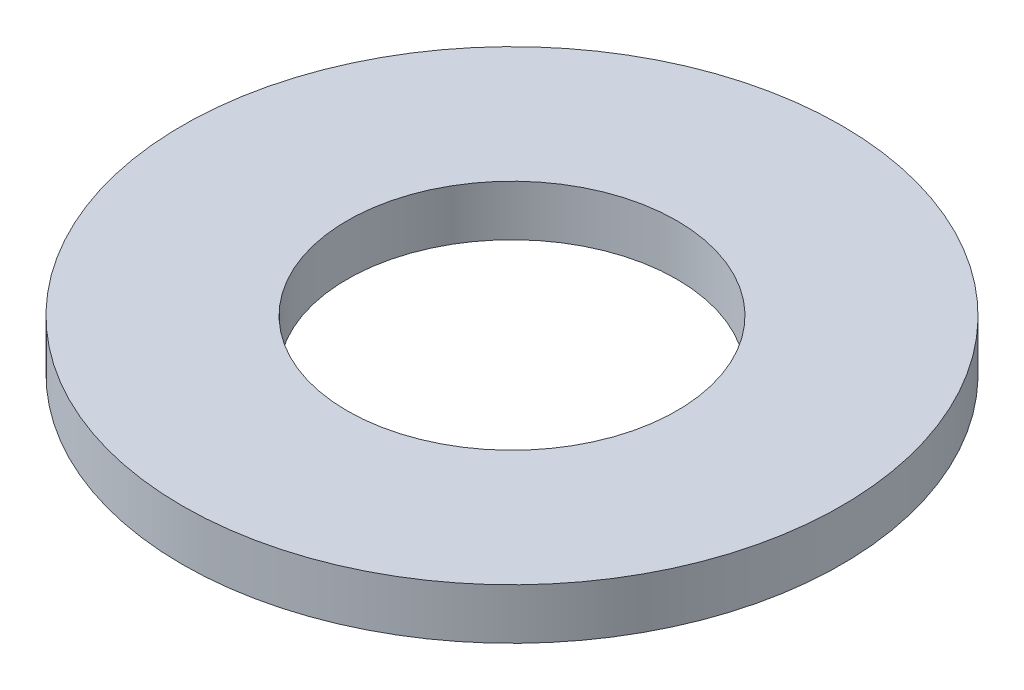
from build123d import *

# Parameters (mm, degrees)
SKETCH1_R           = 3.9624
BOSS_EXTRUDE1_DEPTH = 0.6096
SKETCH5_R           = 1.9812
CUT_EXTRUDE1_DEPTH  = 6.636740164


with BuildPart() as part:
    # Sketch1 → Boss-Extrude1 (new body)
    with BuildSketch(Plane(origin=(0, 0, 0), x_dir=(1, 0, 0), z_dir=(0, 1, 0))):
        with Locations(Location((0, 0, 0), (0, 0, 270))):
            Circle(SKETCH1_R)
    extrude(amount=BOSS_EXTRUDE1_DEPTH)

    # Sketch5 → Cut-Extrude1 (cut, through all)
    with BuildSketch(Plane(origin=(0, 0.6096, 0), x_dir=(-1, 0, 0), z_dir=(0, 1, 0))):
        with Locations(Location((0, 0, 0), (0, 0, 90))):
            Circle(SKETCH5_R)
    extrude(amount=-CUT_EXTRUDE1_DEPTH, mode=Mode.SUBTRACT)


solid = part.part
